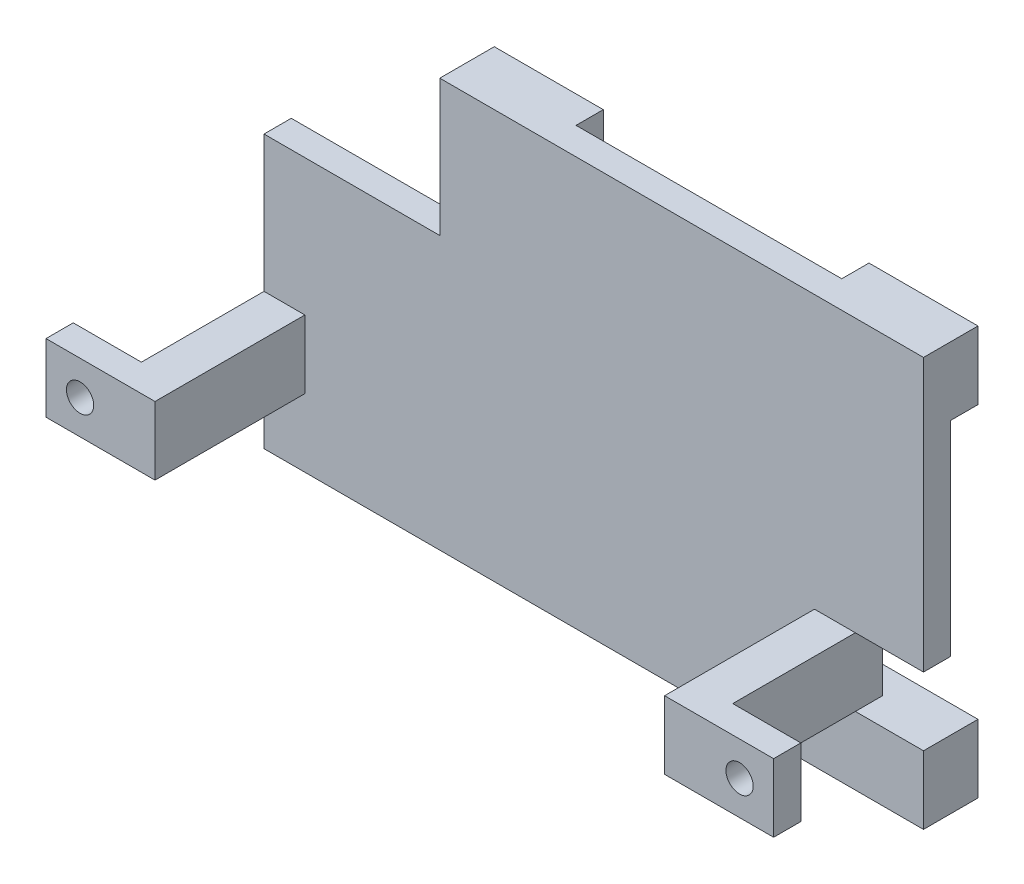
from build123d import *

# Parameters (mm, degrees)
CROQUIS1_W              = 48.4
CROQUIS1_H              = 30
SALIENTE_EXTRUIR1_DEPTH = 2
CROQUIS2_W              = 5
CROQUIS2_H              = 5
CORTAR_EXTRUIR1_DEPTH   = 2
CROQUIS3_W              = 3
CROQUIS3_H              = 5
SALIENTE_EXTRUIR2_DEPTH = 11
CROQUIS4_W              = 5
CROQUIS4_H              = 5
CROQUIS4_R              = 1
SALIENTE_EXTRUIR3_DEPTH = 2
CROQUIS5_W              = 8
CROQUIS5_H              = 5
CROQUIS5_R              = 1
SALIENTE_EXTRUIR4_DEPTH = 2
CROQUIS7_W              = 12.9
CROQUIS7_H              = 10
CORTAR_EXTRUIR2_DEPTH   = 10


with BuildPart() as part:
    # Croquis1 → Saliente-Extruir1 (new body)
    with BuildSketch(Plane.XY):
        with Locations((23.812369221, -1.671019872)):
            Rectangle(CROQUIS1_W, CROQUIS1_H)
    extrude(amount=SALIENTE_EXTRUIR1_DEPTH)

    # Croquis2 → Cortar-Extruir1 (cut)
    with BuildSketch(Plane.XY.offset(2)):
        with Locations((45.512369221, -9.171019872)):
            Rectangle(CROQUIS2_W, CROQUIS2_H)
    extrude(amount=-CORTAR_EXTRUIR1_DEPTH, mode=Mode.SUBTRACT)

    # Croquis3 → Saliente-Extruir2 (add)
    with BuildSketch(Plane.XY.offset(2)):
        with Locations((41.512369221, -9.171019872)):
            Rectangle(CROQUIS3_W, CROQUIS3_H)
        with Locations((1.112369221, -9.171019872)):
            Rectangle(CROQUIS3_W, CROQUIS3_H)
    extrude(amount=SALIENTE_EXTRUIR2_DEPTH)

    # Croquis4 → Saliente-Extruir3 (add)
    # profile 1 of 2: a face of its own
    with BuildSketch(Plane.XY.offset(13)):
        with Locations((-2.887630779, -9.171019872)):
            Rectangle(CROQUIS4_W, CROQUIS4_H)
        with Locations((-2.887630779, -9.171019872)):
            Circle(CROQUIS4_R, mode=Mode.SUBTRACT)
    # profile 2 of 2: a face of its own
    with BuildSketch(Plane.XY.offset(13)):
        with Locations((45.512369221, -9.171019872)):
            Rectangle(CROQUIS4_W, CROQUIS4_H)
        with Locations((45.512369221, -9.171019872)):
            Circle(CROQUIS4_R, mode=Mode.SUBTRACT)
    extrude(amount=-SALIENTE_EXTRUIR3_DEPTH)

    # Croquis5 → Saliente-Extruir4 (add)
    # profile 1 of 4: a face of its own
    with BuildSketch(Plane(origin=(0, 0, 0), x_dir=(-1, 0, 0), z_dir=(0, 0, -1))):
        with Locations((-44.012369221, -14.171019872)):
            Rectangle(CROQUIS5_W, CROQUIS5_H)
        with Locations((-44.512369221, -14.171019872)):
            Circle(CROQUIS5_R, mode=Mode.SUBTRACT)
    # profile 2 of 4: a face of its own
    with BuildSketch(Plane(origin=(0, 0, 0), x_dir=(-1, 0, 0), z_dir=(0, 0, -1))):
        with Locations((-16.512369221, -14.171019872)):
            Rectangle(CROQUIS5_W, CROQUIS5_H)
        with Locations((-14.512369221, -14.171019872)):
            Circle(CROQUIS5_R, mode=Mode.SUBTRACT)
    # profile 3 of 4: a face of its own
    with BuildSketch(Plane(origin=(0, 0, 0), x_dir=(-1, 0, 0), z_dir=(0, 0, -1))):
        with Locations((-16.512369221, 10.828980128)):
            Rectangle(CROQUIS5_W, CROQUIS5_H)
        with Locations((-14.512369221, 10.828980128)):
            Circle(CROQUIS5_R, mode=Mode.SUBTRACT)
    # profile 4 of 4: a face of its own
    with BuildSketch(Plane(origin=(0, 0, 0), x_dir=(-1, 0, 0), z_dir=(0, 0, -1))):
        with Locations((-44.012369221, 10.828980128)):
            Rectangle(CROQUIS5_W, CROQUIS5_H)
        with Locations((-44.512369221, 10.828980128)):
            Circle(CROQUIS5_R, mode=Mode.SUBTRACT)
    extrude(amount=SALIENTE_EXTRUIR4_DEPTH)

    # Croquis7 → Cortar-Extruir2 (cut)
    with BuildSketch(Plane(origin=(0, 0, 0), x_dir=(-1, 0, 0), z_dir=(0, 0, -1))):
        with Locations((-6.062369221, 8.328980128)):
            Rectangle(CROQUIS7_W, CROQUIS7_H)
    extrude(amount=-CORTAR_EXTRUIR2_DEPTH, mode=Mode.SUBTRACT)


solid = part.part
